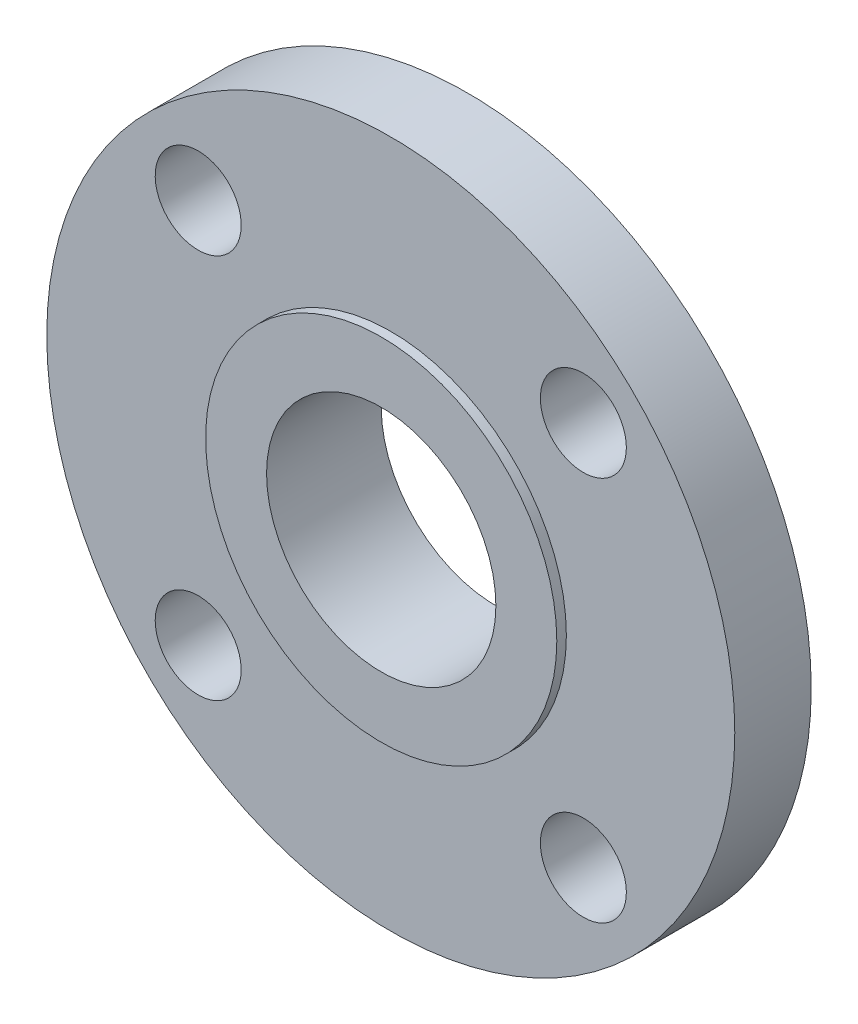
from build123d import *

# Parameters (mm, degrees)
HUB_DIAMETER_R                = 38.89375
HUB_DEPTH                     = 25.4
FLANGE_DIAMETER_R             = 76.2
FLANGE_DEPTH                  = 16.933333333
REVOLUTION_PROFILE_FOR_BORE_W = 25.4
REVOLUTION_PROFILE_FOR_BORE_H = 228.6
BOLT_DIAMETER_R               = 9.525
BOLT_HOLE_DEPTH               = 111.249687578
BOLT_HOLE_PATTERN_COUNT       = 4
BOLT_HOLE_PATTERN_ANGLE       = 270


with BuildPart() as part:
    # Hub Diameter → Hub (new body)
    with BuildSketch(Plane.XY):
        Circle(HUB_DIAMETER_R)
    extrude(amount=-HUB_DEPTH)

    # Flange Diameter → Flange (add)
    with BuildSketch(Plane.XY.offset(-2.116666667)):
        Circle(FLANGE_DIAMETER_R)
    extrude(amount=-FLANGE_DEPTH)

    # Revolution profile for Bore → Bore (revolve, cut)
    with BuildSketch(Plane(origin=(0, 0, 0), x_dir=(1, 0, 0), z_dir=(0, 1, 0))):
        with Locations((12.7, 114.3)):
            Rectangle(REVOLUTION_PROFILE_FOR_BORE_W, REVOLUTION_PROFILE_FOR_BORE_H)
    revolve(axis=Axis((0, 0, 19.52131148), (0, 0, -1)), mode=Mode.SUBTRACT)

    # Bolt Diameter → Bolt Hole (cut, through all)
    with BuildSketch(Plane.XY.offset(-2.116666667)):
        with Locations((42.656216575, 42.656216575)):
            Circle(BOLT_DIAMETER_R)
    bolt_hole = extrude(amount=-BOLT_HOLE_DEPTH, mode=Mode.SUBTRACT)

    # Bolt Hole Pattern: Bolt Hole ×4 about axis
    bolt_hole_pattern_axis = Axis((0, 0, -50), (0, 0, 1))
    for i in range(1, BOLT_HOLE_PATTERN_COUNT):
        add(bolt_hole.rotate(bolt_hole_pattern_axis, i * BOLT_HOLE_PATTERN_ANGLE / (BOLT_HOLE_PATTERN_COUNT - 1)), mode=Mode.SUBTRACT)


solid = part.part
